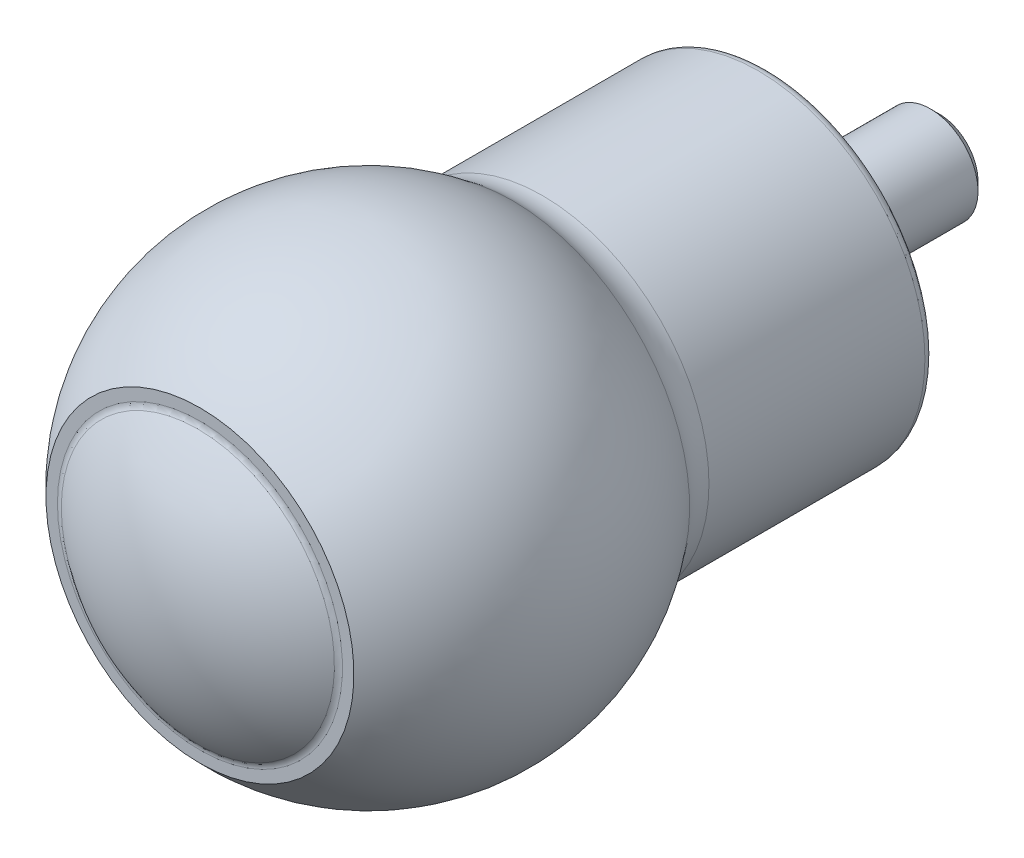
ISO-10303-21;
HEADER;
FILE_DESCRIPTION(('STEP AP214'),'2;1');
FILE_NAME('part.step','',(''),(''),'','','');
FILE_SCHEMA(('AUTOMOTIVE_DESIGN { 1 0 10303 214 1 1 1 1 }'));
ENDSEC;
DATA;
#1=APPLICATION_CONTEXT('core data for automotive mechanical design processes');
#2=APPLICATION_PROTOCOL_DEFINITION('international standard','automotive_design',2000,#1);
#3=PRODUCT_CONTEXT('',#1,'mechanical');
#4=PRODUCT('Part','Part','',(#3));
#5=PRODUCT_RELATED_PRODUCT_CATEGORY('part','',(#4));
#6=PRODUCT_DEFINITION_FORMATION('','',#4);
#7=PRODUCT_DEFINITION_CONTEXT('part definition',#1,'design');
#8=PRODUCT_DEFINITION('design','',#6,#7);
#9=PRODUCT_DEFINITION_SHAPE('','',#8);
#10=(LENGTH_UNIT() NAMED_UNIT(*) SI_UNIT(.MILLI.,.METRE.));
#11=(NAMED_UNIT(*) PLANE_ANGLE_UNIT() SI_UNIT($,.RADIAN.));
#12=(NAMED_UNIT(*) SI_UNIT($,.STERADIAN.) SOLID_ANGLE_UNIT());
#13=UNCERTAINTY_MEASURE_WITH_UNIT(LENGTH_MEASURE(1.E-05),#10,'distance_accuracy_value','');
#14=(GEOMETRIC_REPRESENTATION_CONTEXT(3) GLOBAL_UNCERTAINTY_ASSIGNED_CONTEXT((#13)) GLOBAL_UNIT_ASSIGNED_CONTEXT((#10,
#11,#12)) REPRESENTATION_CONTEXT('',''));
#15=CARTESIAN_POINT('',(0.,0.,0.));
#16=DIRECTION('',(0.,0.,1.));
#17=DIRECTION('',(1.,0.,0.));
#18=AXIS2_PLACEMENT_3D('',#15,#16,#17);
#19=CARTESIAN_POINT('',(0.,0.,-17.));
#20=DIRECTION('',(0.,0.,-1.));
#21=DIRECTION('',(-1.,0.,0.));
#22=AXIS2_PLACEMENT_3D('',#19,#20,#21);
#23=PLANE('',#22);
#24=CARTESIAN_POINT('',(0.,0.,-17.));
#25=DIRECTION('',(0.,0.,-1.));
#26=DIRECTION('',(-1.,0.,0.));
#27=AXIS2_PLACEMENT_3D('',#24,#25,#26);
#28=CIRCLE('',#27,4.08);
#29=CARTESIAN_POINT('',(-4.08,0.,-17.));
#30=VERTEX_POINT('',#29);
#31=EDGE_CURVE('E21',#30,#30,#28,.T.);
#32=ORIENTED_EDGE('',*,*,#31,.T.);
#33=EDGE_LOOP('',(#32));
#34=FACE_BOUND('',#33,.T.);
#35=DIRECTION('',(-0.866025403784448,0.499999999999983,0.));
#36=VECTOR('',#35,1.);
#37=CARTESIAN_POINT('',(2.5,1.4433756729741,-17.));
#38=LINE('',#37,#36);
#39=CARTESIAN_POINT('',(2.5,1.4433756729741,-17.));
#40=VERTEX_POINT('',#39);
#41=CARTESIAN_POINT('',(0.,2.8867513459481,-17.));
#42=VERTEX_POINT('',#41);
#43=EDGE_CURVE('E88',#40,#42,#38,.T.);
#44=ORIENTED_EDGE('',*,*,#43,.T.);
#45=DIRECTION('',(-0.866025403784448,-0.499999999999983,0.));
#46=VECTOR('',#45,1.);
#47=CARTESIAN_POINT('',(0.,2.8867513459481,-17.));
#48=LINE('',#47,#46);
#49=CARTESIAN_POINT('',(-2.5,1.4433756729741,-17.));
#50=VERTEX_POINT('',#49);
#51=EDGE_CURVE('E28',#42,#50,#48,.T.);
#52=ORIENTED_EDGE('',*,*,#51,.T.);
#53=DIRECTION('',(0.,-1.,0.));
#54=VECTOR('',#53,1.);
#55=CARTESIAN_POINT('',(-2.5,1.4433756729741,-17.));
#56=LINE('',#55,#54);
#57=CARTESIAN_POINT('',(-2.5,-1.4433756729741,-17.));
#58=VERTEX_POINT('',#57);
#59=EDGE_CURVE('E68',#50,#58,#56,.T.);
#60=ORIENTED_EDGE('',*,*,#59,.T.);
#61=DIRECTION('',(0.866025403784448,-0.499999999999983,0.));
#62=VECTOR('',#61,1.);
#63=CARTESIAN_POINT('',(-2.5,-1.4433756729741,-17.));
#64=LINE('',#63,#62);
#65=CARTESIAN_POINT('',(0.,-2.8867513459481,-17.));
#66=VERTEX_POINT('',#65);
#67=EDGE_CURVE('E77',#58,#66,#64,.T.);
#68=ORIENTED_EDGE('',*,*,#67,.T.);
#69=DIRECTION('',(0.866025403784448,0.499999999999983,0.));
#70=VECTOR('',#69,1.);
#71=CARTESIAN_POINT('',(0.,-2.8867513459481,-17.));
#72=LINE('',#71,#70);
#73=CARTESIAN_POINT('',(2.5,-1.4433756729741,-17.));
#74=VERTEX_POINT('',#73);
#75=EDGE_CURVE('E631',#66,#74,#72,.T.);
#76=ORIENTED_EDGE('',*,*,#75,.T.);
#77=DIRECTION('',(0.,1.,0.));
#78=VECTOR('',#77,1.);
#79=CARTESIAN_POINT('',(2.5,-1.4433756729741,-17.));
#80=LINE('',#79,#78);
#81=EDGE_CURVE('E635',#74,#40,#80,.T.);
#82=ORIENTED_EDGE('',*,*,#81,.T.);
#83=EDGE_LOOP('',(#44,#52,#60,#68,#76,#82));
#84=FACE_BOUND('',#83,.T.);
#85=ADVANCED_FACE('F14',(#34,#84),#23,.T.);
#86=CARTESIAN_POINT('',(0.,4.08,1.));
#87=DIRECTION('',(0.,0.,-1.));
#88=DIRECTION('',(-1.,0.,0.));
#89=AXIS2_PLACEMENT_3D('',#86,#87,#88);
#90=PLANE('',#89);
#91=CARTESIAN_POINT('',(0.,0.,1.));
#92=DIRECTION('',(0.,0.,-1.));
#93=DIRECTION('',(-1.,0.,0.));
#94=AXIS2_PLACEMENT_3D('',#91,#92,#93);
#95=CIRCLE('',#94,16.5);
#96=CARTESIAN_POINT('',(-16.5,0.,1.));
#97=VERTEX_POINT('',#96);
#98=EDGE_CURVE('E138',#97,#97,#95,.T.);
#99=ORIENTED_EDGE('',*,*,#98,.T.);
#100=EDGE_LOOP('',(#99));
#101=FACE_BOUND('',#100,.T.);
#102=CARTESIAN_POINT('',(0.,0.,1.));
#103=DIRECTION('',(0.,0.,-1.));
#104=DIRECTION('',(-1.,0.,0.));
#105=AXIS2_PLACEMENT_3D('',#102,#103,#104);
#106=CIRCLE('',#105,8.75);
#107=CARTESIAN_POINT('',(-8.75,0.,1.));
#108=VERTEX_POINT('',#107);
#109=EDGE_CURVE('E117',#108,#108,#106,.T.);
#110=ORIENTED_EDGE('',*,*,#109,.F.);
#111=EDGE_LOOP('',(#110));
#112=FACE_BOUND('',#111,.T.);
#113=ADVANCED_FACE('F170',(#101,#112),#90,.T.);
#114=CARTESIAN_POINT('',(0.,0.,1.99999999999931));
#115=DIRECTION('',(0.,0.,-1.));
#116=DIRECTION('',(-1.,0.,0.));
#117=AXIS2_PLACEMENT_3D('',#114,#115,#116);
#118=TOROIDAL_SURFACE('',#117,16.5000000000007,0.999999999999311);
#119=CARTESIAN_POINT('',(0.,0.,2.));
#120=DIRECTION('',(0.,0.,-1.));
#121=DIRECTION('',(-1.,0.,0.));
#122=AXIS2_PLACEMENT_3D('',#119,#120,#121);
#123=CIRCLE('',#122,17.5);
#124=CARTESIAN_POINT('',(-17.5,0.,2.));
#125=VERTEX_POINT('',#124);
#126=EDGE_CURVE('E135',#125,#125,#123,.T.);
#127=ORIENTED_EDGE('',*,*,#126,.T.);
#128=EDGE_LOOP('',(#127));
#129=FACE_BOUND('',#128,.T.);
#130=ORIENTED_EDGE('',*,*,#98,.F.);
#131=EDGE_LOOP('',(#130));
#132=FACE_BOUND('',#131,.T.);
#133=ADVANCED_FACE('F174',(#129,#132),#118,.T.);
#134=CARTESIAN_POINT('',(0.,0.,66.));
#135=DIRECTION('',(0.,0.,-1.));
#136=DIRECTION('',(-1.,0.,0.));
#137=AXIS2_PLACEMENT_3D('',#134,#135,#136);
#138=CYLINDRICAL_SURFACE('',#137,17.5);
#139=CARTESIAN_POINT('',(0.,0.,24.703825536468));
#140=DIRECTION('',(0.,0.,-1.));
#141=DIRECTION('',(-1.,0.,0.));
#142=AXIS2_PLACEMENT_3D('',#139,#140,#141);
#143=CIRCLE('',#142,17.5);
#144=CARTESIAN_POINT('',(-17.5,0.,24.703825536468));
#145=VERTEX_POINT('',#144);
#146=EDGE_CURVE('E132',#145,#145,#143,.T.);
#147=ORIENTED_EDGE('',*,*,#146,.T.);
#148=EDGE_LOOP('',(#147));
#149=FACE_BOUND('',#148,.T.);
#150=ORIENTED_EDGE('',*,*,#126,.F.);
#151=EDGE_LOOP('',(#150));
#152=FACE_BOUND('',#151,.T.);
#153=ADVANCED_FACE('F180',(#149,#152),#138,.T.);
#154=CARTESIAN_POINT('',(0.,0.,24.7038255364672));
#155=DIRECTION('',(0.,0.,-1.));
#156=DIRECTION('',(-1.,0.,0.));
#157=AXIS2_PLACEMENT_3D('',#154,#155,#156);
#158=TOROIDAL_SURFACE('',#157,22.5000000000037,5.00000000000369);
#159=CARTESIAN_POINT('',(0.,0.,27.858338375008));
#160=DIRECTION('',(0.,0.,-1.));
#161=DIRECTION('',(-1.,0.,0.));
#162=AXIS2_PLACEMENT_3D('',#159,#160,#161);
#163=CIRCLE('',#162,18.620689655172);
#164=CARTESIAN_POINT('',(0.,18.6206896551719,27.858338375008));
#165=VERTEX_POINT('',#164);
#166=EDGE_CURVE('E129',#165,#165,#163,.T.);
#167=ORIENTED_EDGE('',*,*,#166,.T.);
#168=EDGE_LOOP('',(#167));
#169=FACE_BOUND('',#168,.T.);
#170=ORIENTED_EDGE('',*,*,#146,.F.);
#171=EDGE_LOOP('',(#170));
#172=FACE_BOUND('',#171,.T.);
#173=ADVANCED_FACE('F361',(#169,#172),#158,.F.);
#174=CARTESIAN_POINT('',(0.,-4.71844785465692E-13,43.));
#175=DIRECTION('',(0.,0.,-1.));
#176=DIRECTION('',(0.,1.,0.));
#177=AXIS2_PLACEMENT_3D('',#174,#175,#176);
#178=SPHERICAL_SURFACE('',#177,24.);
#179=CARTESIAN_POINT('',(0.,0.,60.72));
#180=DIRECTION('',(0.,0.,-1.));
#181=DIRECTION('',(-1.,0.,0.));
#182=AXIS2_PLACEMENT_3D('',#179,#180,#181);
#183=CIRCLE('',#182,16.186463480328);
#184=CARTESIAN_POINT('',(0.,16.1864634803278,60.72));
#185=VERTEX_POINT('',#184);
#186=EDGE_CURVE('E126',#185,#185,#183,.T.);
#187=CARTESIAN_POINT('',(0.,16.1864634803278,60.72));
#188=CARTESIAN_POINT('',(0.,16.4658006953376,60.4648470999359));
#189=CARTESIAN_POINT('',(0.,16.7390946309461,60.203079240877));
#190=CARTESIAN_POINT('',(0.,17.2730072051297,59.6669211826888));
#191=CARTESIAN_POINT('',(0.,17.5336258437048,59.3925309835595));
#192=CARTESIAN_POINT('',(0.,18.0415990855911,58.8317358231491));
#193=CARTESIAN_POINT('',(0.,18.2889536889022,58.5453308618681));
#194=CARTESIAN_POINT('',(0.,18.769847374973,57.9611481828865));
#195=CARTESIAN_POINT('',(0.,19.0033864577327,57.663370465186));
#196=CARTESIAN_POINT('',(0.,19.4561264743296,57.0571076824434));
#197=CARTESIAN_POINT('',(0.,19.675327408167,56.7486226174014));
#198=CARTESIAN_POINT('',(0.,20.0989011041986,56.1216350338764));
#199=CARTESIAN_POINT('',(0.,20.303273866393,55.8031325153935));
#200=CARTESIAN_POINT('',(0.,20.696734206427,55.1568221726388));
#201=CARTESIAN_POINT('',(0.,20.8858217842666,54.8290143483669));
#202=CARTESIAN_POINT('',(0.,21.2482889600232,54.164826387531));
#203=CARTESIAN_POINT('',(0.,21.4216685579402,53.8284462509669));
#204=CARTESIAN_POINT('',(0.,21.7523320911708,53.1478658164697));
#205=CARTESIAN_POINT('',(0.,21.9096160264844,52.8036655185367));
#206=CARTESIAN_POINT('',(0.,22.207736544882,52.1082144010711));
#207=CARTESIAN_POINT('',(0.,22.3485731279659,51.7569635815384));
#208=CARTESIAN_POINT('',(0.,22.6134840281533,51.0481968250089));
#209=CARTESIAN_POINT('',(0.,22.7375583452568,50.690680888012));
#210=CARTESIAN_POINT('',(0.,22.9686672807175,49.9701833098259));
#211=CARTESIAN_POINT('',(0.,23.0757018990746,49.6072016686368));
#212=CARTESIAN_POINT('',(0.,23.2724921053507,48.8765843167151));
#213=CARTESIAN_POINT('',(0.,23.3622476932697,48.5089486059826));
#214=CARTESIAN_POINT('',(0.,23.5242791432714,47.769845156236));
#215=CARTESIAN_POINT('',(0.,23.5965550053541,47.3983774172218));
#216=CARTESIAN_POINT('',(0.,23.7234653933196,46.6524405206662));
#217=CARTESIAN_POINT('',(0.,23.7780999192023,46.2779713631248));
#218=CARTESIAN_POINT('',(0.,23.8696054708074,45.5268689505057));
#219=CARTESIAN_POINT('',(0.,23.9064764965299,45.1502356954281));
#220=CARTESIAN_POINT('',(0.,23.9623726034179,44.3956472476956));
#221=CARTESIAN_POINT('',(0.,23.9813976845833,44.0176920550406));
#222=CARTESIAN_POINT('',(0.,24.0015593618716,43.2613048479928));
#223=CARTESIAN_POINT('',(0.,24.0026959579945,42.8828728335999));
#224=CARTESIAN_POINT('',(0.,23.9870781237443,42.1263781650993));
#225=CARTESIAN_POINT('',(0.,23.9703236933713,41.7483155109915));
#226=CARTESIAN_POINT('',(0.,23.9189612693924,40.993404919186));
#227=CARTESIAN_POINT('',(0.,23.8843532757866,40.6165569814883));
#228=CARTESIAN_POINT('',(0.,23.7973611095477,39.8649184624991));
#229=CARTESIAN_POINT('',(0.,23.7449769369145,39.4901278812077));
#230=CARTESIAN_POINT('',(0.,23.6225495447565,38.7434421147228));
#231=CARTESIAN_POINT('',(0.,23.5525063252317,38.3715469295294));
#232=CARTESIAN_POINT('',(0.,23.3949174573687,37.6314835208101));
#233=CARTESIAN_POINT('',(0.,23.3073718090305,37.2633152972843));
#234=CARTESIAN_POINT('',(0.,23.114973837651,36.5315290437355));
#235=CARTESIAN_POINT('',(0.,23.0101215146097,36.1679110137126));
#236=CARTESIAN_POINT('',(0.,22.7833446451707,35.4460382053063));
#237=CARTESIAN_POINT('',(0.,22.6614200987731,35.087783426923));
#238=CARTESIAN_POINT('',(0.,22.4007714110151,34.3774381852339));
#239=CARTESIAN_POINT('',(0.,22.2620472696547,34.0253477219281));
#240=CARTESIAN_POINT('',(0.,21.9681095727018,33.3281183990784));
#241=CARTESIAN_POINT('',(0.,21.8128960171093,32.9829795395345));
#242=CARTESIAN_POINT('',(0.,21.4863265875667,32.3004251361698));
#243=CARTESIAN_POINT('',(0.,21.3149707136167,31.9630095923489));
#244=CARTESIAN_POINT('',(0.,20.9564996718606,31.2966563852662));
#245=CARTESIAN_POINT('',(0.,20.7693845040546,30.9677187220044));
#246=CARTESIAN_POINT('',(0.,20.3798137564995,30.3190564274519));
#247=CARTESIAN_POINT('',(0.,20.1773581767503,29.9993317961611));
#248=CARTESIAN_POINT('',(0.,19.7575574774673,29.3698118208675));
#249=CARTESIAN_POINT('',(0.,19.5402123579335,29.0600164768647));
#250=CARTESIAN_POINT('',(0.,19.0911253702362,28.4510427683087));
#251=CARTESIAN_POINT('',(0.,18.8593835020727,28.1518644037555));
#252=CARTESIAN_POINT('',(0.,18.6206896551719,27.858338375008));
#253=B_SPLINE_CURVE_WITH_KNOTS('',3,(#187,#188,#189,#190,#191,#192,#193,#194,#195,#196,#197,
#198,#199,#200,#201,#202,#203,#204,#205,#206,#207,#208,#209,#210,#211,#212,#213,#214,#215,#216,
#217,#218,#219,#220,#221,#222,#223,#224,#225,#226,#227,#228,#229,#230,#231,#232,#233,#234,#235,
#236,#237,#238,#239,#240,#241,#242,#243,#244,#245,#246,#247,#248,#249,#250,#251,#252),
.UNSPECIFIED.,.F.,.F.,(4,2,2,2,2,2,2,2,2,2,2,2,2,2,2,2,2,2,2,2,2,2,2,2,2,2,2,2,2,2,2,2,4),(0.,
1.13487807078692,2.26975614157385,3.40463421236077,4.53951228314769,5.67439035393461,
6.80926842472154,7.94414649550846,9.07902456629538,10.2139026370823,11.3487807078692,
12.4836587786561,13.6185368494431,14.75341492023,15.8882929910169,17.0231710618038,
18.1580491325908,19.2929272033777,20.4278052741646,21.5626833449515,22.6975614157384,
23.8324394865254,24.9673175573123,26.1021956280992,27.2370736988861,28.3719517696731,
29.50682984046,30.6417079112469,31.7765859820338,32.9114640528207,34.0463421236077,
35.1812201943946,36.3160982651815),.UNSPECIFIED.);
#254=EDGE_CURVE('BSEAM349',#185,#165,#253,.T.);
#255=ORIENTED_EDGE('',*,*,#186,.T.);
#256=ORIENTED_EDGE('',*,*,#166,.F.);
#257=ORIENTED_EDGE('',*,*,#254,.T.);
#258=ORIENTED_EDGE('',*,*,#254,.F.);
#259=EDGE_LOOP('',(#255,#257,#256,#258));
#260=FACE_BOUND('',#259,.T.);
#261=ADVANCED_FACE('F349',(#260),#178,.T.);
#262=CARTESIAN_POINT('',(0.,16.186463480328,60.72));
#263=DIRECTION('',(0.,0.,1.));
#264=DIRECTION('',(1.,0.,0.));
#265=AXIS2_PLACEMENT_3D('',#262,#263,#264);
#266=PLANE('',#265);
#267=CARTESIAN_POINT('',(0.,0.,60.72));
#268=DIRECTION('',(0.,0.,-1.));
#269=DIRECTION('',(-1.,0.,0.));
#270=AXIS2_PLACEMENT_3D('',#267,#268,#269);
#271=CIRCLE('',#270,14.985296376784);
#272=CARTESIAN_POINT('',(-14.985296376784,0.,60.72));
#273=VERTEX_POINT('',#272);
#274=EDGE_CURVE('E123',#273,#273,#271,.T.);
#275=ORIENTED_EDGE('',*,*,#274,.T.);
#276=EDGE_LOOP('',(#275));
#277=FACE_BOUND('',#276,.T.);
#278=ORIENTED_EDGE('',*,*,#186,.F.);
#279=EDGE_LOOP('',(#278));
#280=FACE_BOUND('',#279,.T.);
#281=ADVANCED_FACE('F337',(#277,#280),#266,.T.);
#282=CARTESIAN_POINT('',(0.,0.,61.7199999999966));
#283=DIRECTION('',(0.,0.,-1.));
#284=DIRECTION('',(-1.,0.,0.));
#285=AXIS2_PLACEMENT_3D('',#282,#283,#284);
#286=TOROIDAL_SURFACE('',#285,14.9852963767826,0.99999999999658);
#287=CARTESIAN_POINT('',(0.,0.,60.940873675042));
#288=DIRECTION('',(0.,0.,-1.));
#289=DIRECTION('',(-1.,0.,0.));
#290=AXIS2_PLACEMENT_3D('',#287,#288,#289);
#291=CIRCLE('',#290,14.358429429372);
#292=CARTESIAN_POINT('',(-14.358429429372,0.,60.940873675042));
#293=VERTEX_POINT('',#292);
#294=EDGE_CURVE('E120',#293,#293,#291,.T.);
#295=ORIENTED_EDGE('',*,*,#294,.T.);
#296=EDGE_LOOP('',(#295));
#297=FACE_BOUND('',#296,.T.);
#298=ORIENTED_EDGE('',*,*,#274,.F.);
#299=EDGE_LOOP('',(#298));
#300=FACE_BOUND('',#299,.T.);
#301=ADVANCED_FACE('F325',(#297,#300),#286,.F.);
#302=CARTESIAN_POINT('',(0.,-8.51315545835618E-13,43.0949330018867));
#303=DIRECTION('',(0.,0.,-1.));
#304=DIRECTION('',(0.,1.,0.));
#305=AXIS2_PLACEMENT_3D('',#302,#303,#304);
#306=SPHERICAL_SURFACE('',#305,22.9050669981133);
#307=ORIENTED_EDGE('',*,*,#294,.F.);
#308=EDGE_LOOP('',(#307));
#309=FACE_BOUND('',#308,.T.);
#310=ADVANCED_FACE('F311',(#309),#306,.T.);
#311=CARTESIAN_POINT('',(0.,0.,0.));
#312=DIRECTION('',(0.,0.,-1.));
#313=DIRECTION('',(-1.,0.,0.));
#314=AXIS2_PLACEMENT_3D('',#311,#312,#313);
#315=PLANE('',#314);
#316=CARTESIAN_POINT('',(0.,0.,0.));
#317=DIRECTION('',(0.,0.,-1.));
#318=DIRECTION('',(-1.,0.,0.));
#319=AXIS2_PLACEMENT_3D('',#316,#317,#318);
#320=CIRCLE('',#319,8.75);
#321=CARTESIAN_POINT('',(-8.75,0.,0.));
#322=VERTEX_POINT('',#321);
#323=EDGE_CURVE('E83',#322,#322,#320,.T.);
#324=ORIENTED_EDGE('',*,*,#323,.T.);
#325=EDGE_LOOP('',(#324));
#326=FACE_BOUND('',#325,.T.);
#327=CARTESIAN_POINT('',(0.,0.,0.));
#328=DIRECTION('',(0.,0.,-1.));
#329=DIRECTION('',(-1.,0.,0.));
#330=AXIS2_PLACEMENT_3D('',#327,#328,#329);
#331=CIRCLE('',#330,4.08);
#332=CARTESIAN_POINT('',(-4.08,0.,0.));
#333=VERTEX_POINT('',#332);
#334=EDGE_CURVE('E9',#333,#333,#331,.F.);
#335=ORIENTED_EDGE('',*,*,#334,.T.);
#336=EDGE_LOOP('',(#335));
#337=FACE_BOUND('',#336,.T.);
#338=ADVANCED_FACE('F166',(#326,#337),#315,.T.);
#339=CARTESIAN_POINT('',(0.,0.,17.25));
#340=DIRECTION('',(0.,0.,-1.));
#341=DIRECTION('',(-1.,0.,0.));
#342=AXIS2_PLACEMENT_3D('',#339,#340,#341);
#343=CYLINDRICAL_SURFACE('',#342,8.75);
#344=ORIENTED_EDGE('',*,*,#109,.T.);
#345=EDGE_LOOP('',(#344));
#346=FACE_BOUND('',#345,.T.);
#347=ORIENTED_EDGE('',*,*,#323,.F.);
#348=EDGE_LOOP('',(#347));
#349=FACE_BOUND('',#348,.T.);
#350=ADVANCED_FACE('F156',(#346,#349),#343,.T.);
#351=CARTESIAN_POINT('',(0.,0.,-17.));
#352=DIRECTION('',(0.,0.,1.));
#353=DIRECTION('',(1.,0.,0.));
#354=AXIS2_PLACEMENT_3D('',#351,#352,#353);
#355=CONICAL_SURFACE('',#354,4.08,0.785398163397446);
#356=CARTESIAN_POINT('',(0.,0.,-16.08));
#357=DIRECTION('',(0.,0.,-1.));
#358=DIRECTION('',(-1.,0.,0.));
#359=AXIS2_PLACEMENT_3D('',#356,#357,#358);
#360=CIRCLE('',#359,5.);
#361=CARTESIAN_POINT('',(-5.,0.,-16.08));
#362=VERTEX_POINT('',#361);
#363=EDGE_CURVE('E147',#362,#362,#360,.T.);
#364=ORIENTED_EDGE('',*,*,#363,.T.);
#365=EDGE_LOOP('',(#364));
#366=FACE_BOUND('',#365,.T.);
#367=ORIENTED_EDGE('',*,*,#31,.F.);
#368=EDGE_LOOP('',(#367));
#369=FACE_BOUND('',#368,.T.);
#370=ADVANCED_FACE('F153',(#366,#369),#355,.T.);
#371=CARTESIAN_POINT('',(0.,0.,66.));
#372=DIRECTION('',(0.,0.,-1.));
#373=DIRECTION('',(-1.,0.,0.));
#374=AXIS2_PLACEMENT_3D('',#371,#372,#373);
#375=CYLINDRICAL_SURFACE('',#374,5.);
#376=CARTESIAN_POINT('',(0.,0.,-2.62));
#377=DIRECTION('',(0.,0.,-1.));
#378=DIRECTION('',(-1.,0.,0.));
#379=AXIS2_PLACEMENT_3D('',#376,#377,#378);
#380=CIRCLE('',#379,5.);
#381=CARTESIAN_POINT('',(-5.,0.,-2.62));
#382=VERTEX_POINT('',#381);
#383=EDGE_CURVE('E144',#382,#382,#380,.T.);
#384=ORIENTED_EDGE('',*,*,#383,.T.);
#385=EDGE_LOOP('',(#384));
#386=FACE_BOUND('',#385,.T.);
#387=ORIENTED_EDGE('',*,*,#363,.F.);
#388=EDGE_LOOP('',(#387));
#389=FACE_BOUND('',#388,.T.);
#390=ADVANCED_FACE('F155',(#386,#389),#375,.T.);
#391=CARTESIAN_POINT('',(0.,0.,-2.62));
#392=DIRECTION('',(0.,0.,-1.));
#393=DIRECTION('',(-1.,0.,0.));
#394=AXIS2_PLACEMENT_3D('',#391,#392,#393);
#395=CONICAL_SURFACE('',#394,5.,0.785398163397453);
#396=CARTESIAN_POINT('',(0.,0.,-1.7));
#397=DIRECTION('',(0.,0.,-1.));
#398=DIRECTION('',(-1.,0.,0.));
#399=AXIS2_PLACEMENT_3D('',#396,#397,#398);
#400=CIRCLE('',#399,4.08);
#401=CARTESIAN_POINT('',(-4.08,0.,-1.7));
#402=VERTEX_POINT('',#401);
#403=EDGE_CURVE('E141',#402,#402,#400,.T.);
#404=ORIENTED_EDGE('',*,*,#403,.T.);
#405=EDGE_LOOP('',(#404));
#406=FACE_BOUND('',#405,.T.);
#407=ORIENTED_EDGE('',*,*,#383,.F.);
#408=EDGE_LOOP('',(#407));
#409=FACE_BOUND('',#408,.T.);
#410=ADVANCED_FACE('F163',(#406,#409),#395,.T.);
#411=CARTESIAN_POINT('',(0.,0.,66.));
#412=DIRECTION('',(0.,0.,-1.));
#413=DIRECTION('',(-1.,0.,0.));
#414=AXIS2_PLACEMENT_3D('',#411,#412,#413);
#415=CYLINDRICAL_SURFACE('',#414,4.08);
#416=ORIENTED_EDGE('',*,*,#334,.F.);
#417=EDGE_LOOP('',(#416));
#418=FACE_BOUND('',#417,.T.);
#419=ORIENTED_EDGE('',*,*,#403,.F.);
#420=EDGE_LOOP('',(#419));
#421=FACE_BOUND('',#420,.T.);
#422=ADVANCED_FACE('F186',(#418,#421),#415,.T.);
#423=CARTESIAN_POINT('',(0.,2.8867513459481,-12.));
#424=DIRECTION('',(0.499999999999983,-0.866025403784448,0.));
#425=DIRECTION('',(0.866025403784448,0.499999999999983,0.));
#426=AXIS2_PLACEMENT_3D('',#423,#424,#425);
#427=PLANE('',#426);
#428=ORIENTED_EDGE('',*,*,#51,.F.);
#429=DIRECTION('',(0.,0.,-1.));
#430=VECTOR('',#429,1.);
#431=CARTESIAN_POINT('',(0.,2.8867513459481,-12.));
#432=LINE('',#431,#430);
#433=CARTESIAN_POINT('',(0.,2.8867513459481,-12.));
#434=VERTEX_POINT('',#433);
#435=EDGE_CURVE('E105',#434,#42,#432,.T.);
#436=ORIENTED_EDGE('',*,*,#435,.F.);
#437=DIRECTION('',(-0.866025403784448,-0.499999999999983,0.));
#438=VECTOR('',#437,1.);
#439=CARTESIAN_POINT('',(0.,2.8867513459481,-12.));
#440=LINE('',#439,#438);
#441=CARTESIAN_POINT('',(-2.5,1.4433756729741,-12.));
#442=VERTEX_POINT('',#441);
#443=EDGE_CURVE('E82',#434,#442,#440,.T.);
#444=ORIENTED_EDGE('',*,*,#443,.T.);
#445=DIRECTION('',(0.,0.,-1.));
#446=VECTOR('',#445,1.);
#447=CARTESIAN_POINT('',(-2.5,1.4433756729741,-12.));
#448=LINE('',#447,#446);
#449=EDGE_CURVE('E70',#442,#50,#448,.T.);
#450=ORIENTED_EDGE('',*,*,#449,.T.);
#451=EDGE_LOOP('',(#428,#436,#444,#450));
#452=FACE_BOUND('',#451,.T.);
#453=ADVANCED_FACE('F80',(#452),#427,.T.);
#454=CARTESIAN_POINT('',(-2.5,1.4433756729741,-12.));
#455=DIRECTION('',(1.,0.,0.));
#456=DIRECTION('',(0.,0.,-1.));
#457=AXIS2_PLACEMENT_3D('',#454,#455,#456);
#458=PLANE('',#457);
#459=ORIENTED_EDGE('',*,*,#59,.F.);
#460=ORIENTED_EDGE('',*,*,#449,.F.);
#461=DIRECTION('',(0.,-1.,0.));
#462=VECTOR('',#461,1.);
#463=CARTESIAN_POINT('',(-2.5,1.4433756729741,-12.));
#464=LINE('',#463,#462);
#465=CARTESIAN_POINT('',(-2.5,-1.4433756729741,-12.));
#466=VERTEX_POINT('',#465);
#467=EDGE_CURVE('E96',#442,#466,#464,.T.);
#468=ORIENTED_EDGE('',*,*,#467,.T.);
#469=DIRECTION('',(0.,0.,-1.));
#470=VECTOR('',#469,1.);
#471=CARTESIAN_POINT('',(-2.5,-1.4433756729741,-12.));
#472=LINE('',#471,#470);
#473=EDGE_CURVE('E72',#466,#58,#472,.T.);
#474=ORIENTED_EDGE('',*,*,#473,.T.);
#475=EDGE_LOOP('',(#459,#460,#468,#474));
#476=FACE_BOUND('',#475,.T.);
#477=ADVANCED_FACE('F69',(#476),#458,.T.);
#478=CARTESIAN_POINT('',(-2.5,-1.4433756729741,-12.));
#479=DIRECTION('',(0.499999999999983,0.866025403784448,0.));
#480=DIRECTION('',(-0.866025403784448,0.499999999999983,0.));
#481=AXIS2_PLACEMENT_3D('',#478,#479,#480);
#482=PLANE('',#481);
#483=ORIENTED_EDGE('',*,*,#67,.F.);
#484=ORIENTED_EDGE('',*,*,#473,.F.);
#485=DIRECTION('',(0.866025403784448,-0.499999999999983,0.));
#486=VECTOR('',#485,1.);
#487=CARTESIAN_POINT('',(-2.5,-1.4433756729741,-12.));
#488=LINE('',#487,#486);
#489=CARTESIAN_POINT('',(0.,-2.8867513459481,-12.));
#490=VERTEX_POINT('',#489);
#491=EDGE_CURVE('E98',#466,#490,#488,.T.);
#492=ORIENTED_EDGE('',*,*,#491,.T.);
#493=DIRECTION('',(0.,0.,-1.));
#494=VECTOR('',#493,1.);
#495=CARTESIAN_POINT('',(0.,-2.8867513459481,-12.));
#496=LINE('',#495,#494);
#497=EDGE_CURVE('E112',#490,#66,#496,.T.);
#498=ORIENTED_EDGE('',*,*,#497,.T.);
#499=EDGE_LOOP('',(#483,#484,#492,#498));
#500=FACE_BOUND('',#499,.T.);
#501=ADVANCED_FACE('F223',(#500),#482,.T.);
#502=CARTESIAN_POINT('',(0.,-2.8867513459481,-12.));
#503=DIRECTION('',(-0.499999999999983,0.866025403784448,0.));
#504=DIRECTION('',(-0.866025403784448,-0.499999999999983,0.));
#505=AXIS2_PLACEMENT_3D('',#502,#503,#504);
#506=PLANE('',#505);
#507=ORIENTED_EDGE('',*,*,#75,.F.);
#508=ORIENTED_EDGE('',*,*,#497,.F.);
#509=DIRECTION('',(0.866025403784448,0.499999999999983,0.));
#510=VECTOR('',#509,1.);
#511=CARTESIAN_POINT('',(0.,-2.8867513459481,-12.));
#512=LINE('',#511,#510);
#513=CARTESIAN_POINT('',(2.5,-1.4433756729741,-12.));
#514=VERTEX_POINT('',#513);
#515=EDGE_CURVE('E100',#490,#514,#512,.T.);
#516=ORIENTED_EDGE('',*,*,#515,.T.);
#517=DIRECTION('',(0.,0.,-1.));
#518=VECTOR('',#517,1.);
#519=CARTESIAN_POINT('',(2.5,-1.4433756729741,-12.));
#520=LINE('',#519,#518);
#521=EDGE_CURVE('E110',#514,#74,#520,.T.);
#522=ORIENTED_EDGE('',*,*,#521,.T.);
#523=EDGE_LOOP('',(#507,#508,#516,#522));
#524=FACE_BOUND('',#523,.T.);
#525=ADVANCED_FACE('F231',(#524),#506,.T.);
#526=CARTESIAN_POINT('',(2.5,-1.4433756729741,-12.));
#527=DIRECTION('',(-1.,0.,0.));
#528=DIRECTION('',(0.,0.,1.));
#529=AXIS2_PLACEMENT_3D('',#526,#527,#528);
#530=PLANE('',#529);
#531=ORIENTED_EDGE('',*,*,#81,.F.);
#532=ORIENTED_EDGE('',*,*,#521,.F.);
#533=DIRECTION('',(0.,1.,0.));
#534=VECTOR('',#533,1.);
#535=CARTESIAN_POINT('',(2.5,-1.4433756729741,-12.));
#536=LINE('',#535,#534);
#537=CARTESIAN_POINT('',(2.5,1.4433756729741,-12.));
#538=VERTEX_POINT('',#537);
#539=EDGE_CURVE('E102',#514,#538,#536,.T.);
#540=ORIENTED_EDGE('',*,*,#539,.T.);
#541=DIRECTION('',(0.,0.,-1.));
#542=VECTOR('',#541,1.);
#543=CARTESIAN_POINT('',(2.5,1.4433756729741,-12.));
#544=LINE('',#543,#542);
#545=EDGE_CURVE('E108',#538,#40,#544,.T.);
#546=ORIENTED_EDGE('',*,*,#545,.T.);
#547=EDGE_LOOP('',(#531,#532,#540,#546));
#548=FACE_BOUND('',#547,.T.);
#549=ADVANCED_FACE('F240',(#548),#530,.T.);
#550=CARTESIAN_POINT('',(2.5,1.4433756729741,-12.));
#551=DIRECTION('',(-0.499999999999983,-0.866025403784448,0.));
#552=DIRECTION('',(0.866025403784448,-0.499999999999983,0.));
#553=AXIS2_PLACEMENT_3D('',#550,#551,#552);
#554=PLANE('',#553);
#555=ORIENTED_EDGE('',*,*,#43,.F.);
#556=ORIENTED_EDGE('',*,*,#545,.F.);
#557=DIRECTION('',(-0.866025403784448,0.499999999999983,0.));
#558=VECTOR('',#557,1.);
#559=CARTESIAN_POINT('',(2.5,1.4433756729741,-12.));
#560=LINE('',#559,#558);
#561=EDGE_CURVE('E35',#538,#434,#560,.T.);
#562=ORIENTED_EDGE('',*,*,#561,.T.);
#563=ORIENTED_EDGE('',*,*,#435,.T.);
#564=EDGE_LOOP('',(#555,#556,#562,#563));
#565=FACE_BOUND('',#564,.T.);
#566=ADVANCED_FACE('F249',(#565),#554,.T.);
#567=CARTESIAN_POINT('',(-2.5,1.4433756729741,-12.));
#568=DIRECTION('',(0.,0.,1.));
#569=DIRECTION('',(0.,1.,0.));
#570=AXIS2_PLACEMENT_3D('',#567,#568,#569);
#571=PLANE('',#570);
#572=ORIENTED_EDGE('',*,*,#443,.F.);
#573=ORIENTED_EDGE('',*,*,#561,.F.);
#574=ORIENTED_EDGE('',*,*,#539,.F.);
#575=ORIENTED_EDGE('',*,*,#515,.F.);
#576=ORIENTED_EDGE('',*,*,#491,.F.);
#577=ORIENTED_EDGE('',*,*,#467,.F.);
#578=EDGE_LOOP('',(#572,#573,#574,#575,#576,#577));
#579=FACE_BOUND('',#578,.T.);
#580=ADVANCED_FACE('F258',(#579),#571,.F.);
#581=CLOSED_SHELL('',(#85,#113,#133,#153,#173,#261,#281,#301,#310,#338,#350,#370,#390,#410,#422,
#453,#477,#501,#525,#549,#566,#580));
#582=MANIFOLD_SOLID_BREP('B1',#581);
#583=ADVANCED_BREP_SHAPE_REPRESENTATION('',(#18,#582),#14);
#584=SHAPE_DEFINITION_REPRESENTATION(#9,#583);
ENDSEC;
END-ISO-10303-21;
